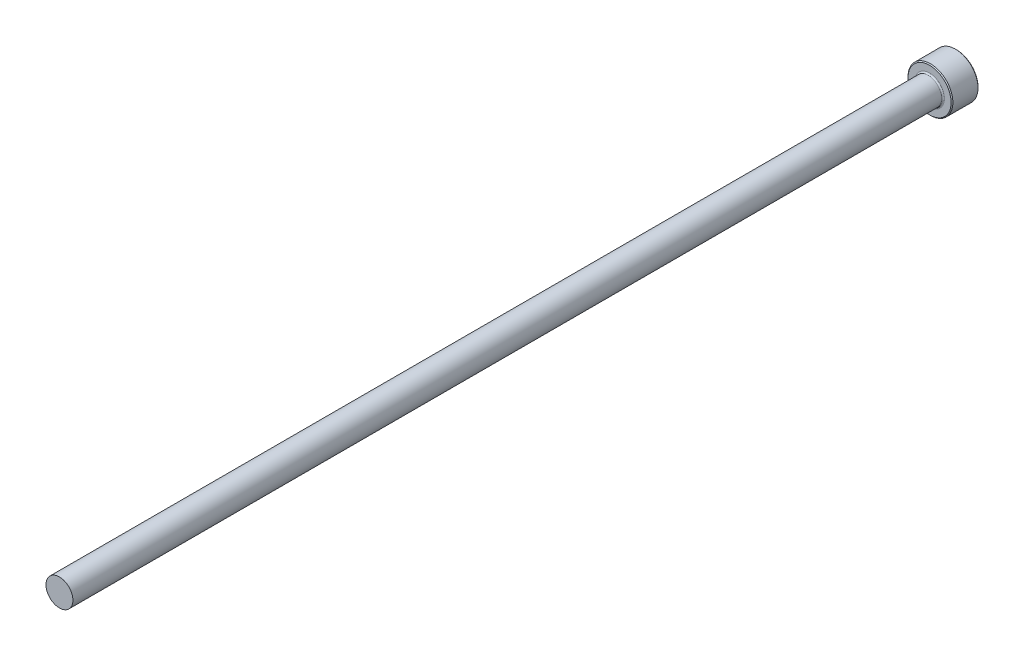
ISO-10303-21;
HEADER;
FILE_DESCRIPTION(('STEP AP214'),'2;1');
FILE_NAME('part.step','',(''),(''),'','','');
FILE_SCHEMA(('AUTOMOTIVE_DESIGN { 1 0 10303 214 1 1 1 1 }'));
ENDSEC;
DATA;
#1=APPLICATION_CONTEXT('core data for automotive mechanical design processes');
#2=APPLICATION_PROTOCOL_DEFINITION('international standard','automotive_design',2000,#1);
#3=PRODUCT_CONTEXT('',#1,'mechanical');
#4=PRODUCT('Part','Part','',(#3));
#5=PRODUCT_RELATED_PRODUCT_CATEGORY('part','',(#4));
#6=PRODUCT_DEFINITION_FORMATION('','',#4);
#7=PRODUCT_DEFINITION_CONTEXT('part definition',#1,'design');
#8=PRODUCT_DEFINITION('design','',#6,#7);
#9=PRODUCT_DEFINITION_SHAPE('','',#8);
#10=(LENGTH_UNIT() NAMED_UNIT(*) SI_UNIT(.MILLI.,.METRE.));
#11=(NAMED_UNIT(*) PLANE_ANGLE_UNIT() SI_UNIT($,.RADIAN.));
#12=(NAMED_UNIT(*) SI_UNIT($,.STERADIAN.) SOLID_ANGLE_UNIT());
#13=UNCERTAINTY_MEASURE_WITH_UNIT(LENGTH_MEASURE(1.E-05),#10,'distance_accuracy_value','');
#14=(GEOMETRIC_REPRESENTATION_CONTEXT(3) GLOBAL_UNCERTAINTY_ASSIGNED_CONTEXT((#13)) GLOBAL_UNIT_ASSIGNED_CONTEXT((#10,
#11,#12)) REPRESENTATION_CONTEXT('',''));
#15=CARTESIAN_POINT('',(0.,0.,0.));
#16=DIRECTION('',(0.,0.,1.));
#17=DIRECTION('',(1.,0.,0.));
#18=AXIS2_PLACEMENT_3D('',#15,#16,#17);
#19=CARTESIAN_POINT('',(0.,2.99999999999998,200.));
#20=DIRECTION('',(0.,0.,-1.));
#21=DIRECTION('',(-1.,0.,0.));
#22=AXIS2_PLACEMENT_3D('',#19,#20,#21);
#23=PLANE('',#22);
#24=CARTESIAN_POINT('',(0.,0.,200.));
#25=DIRECTION('',(0.,0.,1.));
#26=DIRECTION('',(1.,0.,0.));
#27=AXIS2_PLACEMENT_3D('',#24,#25,#26);
#28=CIRCLE('',#27,2.99999999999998);
#29=CARTESIAN_POINT('',(2.99999999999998,0.,200.));
#30=VERTEX_POINT('',#29);
#31=EDGE_CURVE('E50',#30,#30,#28,.T.);
#32=ORIENTED_EDGE('',*,*,#31,.T.);
#33=EDGE_LOOP('',(#32));
#34=FACE_BOUND('',#33,.T.);
#35=ADVANCED_FACE('F30',(#34),#23,.F.);
#36=CARTESIAN_POINT('',(0.,0.,109.050628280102));
#37=DIRECTION('',(0.,0.,1.));
#38=DIRECTION('',(1.,0.,0.));
#39=AXIS2_PLACEMENT_3D('',#36,#37,#38);
#40=CYLINDRICAL_SURFACE('',#39,2.99999999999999);
#41=ORIENTED_EDGE('',*,*,#31,.F.);
#42=EDGE_LOOP('',(#41));
#43=FACE_BOUND('',#42,.T.);
#44=CARTESIAN_POINT('',(0.,0.,6.3));
#45=DIRECTION('',(0.,0.,1.));
#46=DIRECTION('',(1.,0.,0.));
#47=AXIS2_PLACEMENT_3D('',#44,#45,#46);
#48=CIRCLE('',#47,3.);
#49=CARTESIAN_POINT('',(3.,0.,6.3));
#50=VERTEX_POINT('',#49);
#51=EDGE_CURVE('E53',#50,#50,#48,.T.);
#52=ORIENTED_EDGE('',*,*,#51,.T.);
#53=EDGE_LOOP('',(#52));
#54=FACE_BOUND('',#53,.T.);
#55=ADVANCED_FACE('F73',(#43,#54),#40,.T.);
#56=CARTESIAN_POINT('',(0.,0.,6.3));
#57=DIRECTION('',(0.,0.,1.));
#58=DIRECTION('',(1.,0.,0.));
#59=AXIS2_PLACEMENT_3D('',#56,#57,#58);
#60=TOROIDAL_SURFACE('',#59,3.3,0.3);
#61=ORIENTED_EDGE('',*,*,#51,.F.);
#62=EDGE_LOOP('',(#61));
#63=FACE_BOUND('',#62,.T.);
#64=CARTESIAN_POINT('',(0.,0.,6.00000000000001));
#65=DIRECTION('',(0.,0.,1.));
#66=DIRECTION('',(1.,0.,0.));
#67=AXIS2_PLACEMENT_3D('',#64,#65,#66);
#68=CIRCLE('',#67,3.3);
#69=CARTESIAN_POINT('',(3.3,0.,6.00000000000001));
#70=VERTEX_POINT('',#69);
#71=EDGE_CURVE('E56',#70,#70,#68,.T.);
#72=ORIENTED_EDGE('',*,*,#71,.T.);
#73=EDGE_LOOP('',(#72));
#74=FACE_BOUND('',#73,.T.);
#75=ADVANCED_FACE('F60',(#63,#74),#60,.F.);
#76=CARTESIAN_POINT('',(0.,5.,6.));
#77=DIRECTION('',(0.,0.,-1.));
#78=DIRECTION('',(-1.,0.,0.));
#79=AXIS2_PLACEMENT_3D('',#76,#77,#78);
#80=PLANE('',#79);
#81=CARTESIAN_POINT('',(0.,0.,6.));
#82=DIRECTION('',(0.,0.,-1.));
#83=DIRECTION('',(-1.,0.,0.));
#84=AXIS2_PLACEMENT_3D('',#81,#82,#83);
#85=CIRCLE('',#84,4.8);
#86=CARTESIAN_POINT('',(-4.8,0.,6.));
#87=VERTEX_POINT('',#86);
#88=EDGE_CURVE('E10',#87,#87,#85,.F.);
#89=ORIENTED_EDGE('',*,*,#88,.T.);
#90=EDGE_LOOP('',(#89));
#91=FACE_BOUND('',#90,.T.);
#92=ORIENTED_EDGE('',*,*,#71,.F.);
#93=EDGE_LOOP('',(#92));
#94=FACE_BOUND('',#93,.T.);
#95=ADVANCED_FACE('F62',(#91,#94),#80,.F.);
#96=CARTESIAN_POINT('',(0.,0.,109.050628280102));
#97=DIRECTION('',(0.,0.,1.));
#98=DIRECTION('',(1.,0.,0.));
#99=AXIS2_PLACEMENT_3D('',#96,#97,#98);
#100=CYLINDRICAL_SURFACE('',#99,5.);
#101=CARTESIAN_POINT('',(0.,0.,0.200000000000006));
#102=DIRECTION('',(0.,0.,1.));
#103=DIRECTION('',(1.,0.,0.));
#104=AXIS2_PLACEMENT_3D('',#101,#102,#103);
#105=CIRCLE('',#104,5.);
#106=CARTESIAN_POINT('',(5.,0.,0.200000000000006));
#107=VERTEX_POINT('',#106);
#108=EDGE_CURVE('E41',#107,#107,#105,.T.);
#109=ORIENTED_EDGE('',*,*,#108,.T.);
#110=EDGE_LOOP('',(#109));
#111=FACE_BOUND('',#110,.T.);
#112=CARTESIAN_POINT('',(0.,0.,5.80000000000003));
#113=DIRECTION('',(0.,0.,-1.));
#114=DIRECTION('',(-1.,0.,0.));
#115=AXIS2_PLACEMENT_3D('',#112,#113,#114);
#116=CIRCLE('',#115,5.);
#117=CARTESIAN_POINT('',(-5.,0.,5.80000000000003));
#118=VERTEX_POINT('',#117);
#119=EDGE_CURVE('E45',#118,#118,#116,.T.);
#120=ORIENTED_EDGE('',*,*,#119,.T.);
#121=EDGE_LOOP('',(#120));
#122=FACE_BOUND('',#121,.T.);
#123=ADVANCED_FACE('F64',(#111,#122),#100,.T.);
#124=CARTESIAN_POINT('',(0.,0.,0.));
#125=DIRECTION('',(0.,0.,1.));
#126=DIRECTION('',(1.,0.,0.));
#127=AXIS2_PLACEMENT_3D('',#124,#125,#126);
#128=PLANE('',#127);
#129=CARTESIAN_POINT('',(0.,0.,0.));
#130=DIRECTION('',(0.,0.,1.));
#131=DIRECTION('',(1.,0.,0.));
#132=AXIS2_PLACEMENT_3D('',#129,#130,#131);
#133=CIRCLE('',#132,4.8);
#134=CARTESIAN_POINT('',(4.8,0.,0.));
#135=VERTEX_POINT('',#134);
#136=EDGE_CURVE('E37',#135,#135,#133,.F.);
#137=ORIENTED_EDGE('',*,*,#136,.T.);
#138=EDGE_LOOP('',(#137));
#139=FACE_BOUND('',#138,.T.);
#140=ADVANCED_FACE('F70',(#139),#128,.F.);
#141=CARTESIAN_POINT('',(0.,0.,0.200000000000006));
#142=DIRECTION('',(0.,0.,1.));
#143=DIRECTION('',(1.,0.,0.));
#144=AXIS2_PLACEMENT_3D('',#141,#142,#143);
#145=CONICAL_SURFACE('',#144,5.,0.785398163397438);
#146=ORIENTED_EDGE('',*,*,#136,.F.);
#147=EDGE_LOOP('',(#146));
#148=FACE_BOUND('',#147,.T.);
#149=ORIENTED_EDGE('',*,*,#108,.F.);
#150=EDGE_LOOP('',(#149));
#151=FACE_BOUND('',#150,.T.);
#152=ADVANCED_FACE('F84',(#148,#151),#145,.T.);
#153=CARTESIAN_POINT('',(0.,0.,6.00000000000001));
#154=DIRECTION('',(0.,0.,-1.));
#155=DIRECTION('',(-1.,0.,0.));
#156=AXIS2_PLACEMENT_3D('',#153,#154,#155);
#157=CONICAL_SURFACE('',#156,4.8,0.785398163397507);
#158=CARTESIAN_POINT('',(-5.,0.,5.80000000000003));
#159=CARTESIAN_POINT('',(-4.99791666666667,0.,5.80208333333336));
#160=CARTESIAN_POINT('',(-4.99583333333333,0.,5.80416666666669));
#161=CARTESIAN_POINT('',(-4.99166666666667,0.,5.80833333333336));
#162=CARTESIAN_POINT('',(-4.98958333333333,0.,5.81041666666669));
#163=CARTESIAN_POINT('',(-4.98541666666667,0.,5.81458333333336));
#164=CARTESIAN_POINT('',(-4.98333333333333,0.,5.81666666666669));
#165=CARTESIAN_POINT('',(-4.97916666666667,0.,5.82083333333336));
#166=CARTESIAN_POINT('',(-4.97708333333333,0.,5.82291666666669));
#167=CARTESIAN_POINT('',(-4.97291666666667,0.,5.82708333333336));
#168=CARTESIAN_POINT('',(-4.97083333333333,0.,5.82916666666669));
#169=CARTESIAN_POINT('',(-4.96666666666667,0.,5.83333333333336));
#170=CARTESIAN_POINT('',(-4.96458333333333,0.,5.83541666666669));
#171=CARTESIAN_POINT('',(-4.96041666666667,0.,5.83958333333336));
#172=CARTESIAN_POINT('',(-4.95833333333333,0.,5.84166666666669));
#173=CARTESIAN_POINT('',(-4.95416666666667,0.,5.84583333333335));
#174=CARTESIAN_POINT('',(-4.95208333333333,0.,5.84791666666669));
#175=CARTESIAN_POINT('',(-4.94791666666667,0.,5.85208333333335));
#176=CARTESIAN_POINT('',(-4.94583333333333,0.,5.85416666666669));
#177=CARTESIAN_POINT('',(-4.94166666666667,0.,5.85833333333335));
#178=CARTESIAN_POINT('',(-4.93958333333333,0.,5.86041666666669));
#179=CARTESIAN_POINT('',(-4.93541666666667,0.,5.86458333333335));
#180=CARTESIAN_POINT('',(-4.93333333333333,0.,5.86666666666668));
#181=CARTESIAN_POINT('',(-4.92916666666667,0.,5.87083333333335));
#182=CARTESIAN_POINT('',(-4.92708333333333,0.,5.87291666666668));
#183=CARTESIAN_POINT('',(-4.92291666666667,0.,5.87708333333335));
#184=CARTESIAN_POINT('',(-4.92083333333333,0.,5.87916666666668));
#185=CARTESIAN_POINT('',(-4.91666666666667,0.,5.88333333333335));
#186=CARTESIAN_POINT('',(-4.91458333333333,0.,5.88541666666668));
#187=CARTESIAN_POINT('',(-4.91041666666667,0.,5.88958333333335));
#188=CARTESIAN_POINT('',(-4.90833333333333,0.,5.89166666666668));
#189=CARTESIAN_POINT('',(-4.90416666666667,0.,5.89583333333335));
#190=CARTESIAN_POINT('',(-4.90208333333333,0.,5.89791666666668));
#191=CARTESIAN_POINT('',(-4.89791666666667,0.,5.90208333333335));
#192=CARTESIAN_POINT('',(-4.89583333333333,0.,5.90416666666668));
#193=CARTESIAN_POINT('',(-4.89166666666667,0.,5.90833333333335));
#194=CARTESIAN_POINT('',(-4.88958333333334,0.,5.91041666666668));
#195=CARTESIAN_POINT('',(-4.88541666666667,0.,5.91458333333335));
#196=CARTESIAN_POINT('',(-4.88333333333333,0.,5.91666666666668));
#197=CARTESIAN_POINT('',(-4.87916666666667,0.,5.92083333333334));
#198=CARTESIAN_POINT('',(-4.87708333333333,0.,5.92291666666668));
#199=CARTESIAN_POINT('',(-4.87291666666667,0.,5.92708333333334));
#200=CARTESIAN_POINT('',(-4.87083333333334,0.,5.92916666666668));
#201=CARTESIAN_POINT('',(-4.86666666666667,0.,5.93333333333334));
#202=CARTESIAN_POINT('',(-4.86458333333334,0.,5.93541666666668));
#203=CARTESIAN_POINT('',(-4.86041666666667,0.,5.93958333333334));
#204=CARTESIAN_POINT('',(-4.85833333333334,0.,5.94166666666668));
#205=CARTESIAN_POINT('',(-4.85416666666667,0.,5.94583333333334));
#206=CARTESIAN_POINT('',(-4.85208333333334,0.,5.94791666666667));
#207=CARTESIAN_POINT('',(-4.84791666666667,0.,5.95208333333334));
#208=CARTESIAN_POINT('',(-4.84583333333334,0.,5.95416666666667));
#209=CARTESIAN_POINT('',(-4.84166666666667,0.,5.95833333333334));
#210=CARTESIAN_POINT('',(-4.83958333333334,0.,5.96041666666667));
#211=CARTESIAN_POINT('',(-4.83541666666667,0.,5.96458333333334));
#212=CARTESIAN_POINT('',(-4.83333333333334,0.,5.96666666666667));
#213=CARTESIAN_POINT('',(-4.82916666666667,0.,5.97083333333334));
#214=CARTESIAN_POINT('',(-4.82708333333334,0.,5.97291666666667));
#215=CARTESIAN_POINT('',(-4.82291666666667,0.,5.97708333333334));
#216=CARTESIAN_POINT('',(-4.82083333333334,0.,5.97916666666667));
#217=CARTESIAN_POINT('',(-4.81666666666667,0.,5.98333333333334));
#218=CARTESIAN_POINT('',(-4.81458333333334,0.,5.98541666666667));
#219=CARTESIAN_POINT('',(-4.81041666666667,0.,5.98958333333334));
#220=CARTESIAN_POINT('',(-4.80833333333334,0.,5.99166666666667));
#221=CARTESIAN_POINT('',(-4.80416666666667,0.,5.99583333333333));
#222=CARTESIAN_POINT('',(-4.80208333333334,0.,5.99791666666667));
#223=CARTESIAN_POINT('',(-4.8,0.,6.));
#224=B_SPLINE_CURVE_WITH_KNOTS('',3,(#158,#159,#160,#161,#162,#163,#164,#165,#166,#167,#168,
#169,#170,#171,#172,#173,#174,#175,#176,#177,#178,#179,#180,#181,#182,#183,#184,#185,#186,#187,
#188,#189,#190,#191,#192,#193,#194,#195,#196,#197,#198,#199,#200,#201,#202,#203,#204,#205,#206,
#207,#208,#209,#210,#211,#212,#213,#214,#215,#216,#217,#218,#219,#220,#221,#222,#223),
.UNSPECIFIED.,.F.,.F.,(4,2,2,2,2,2,2,2,2,2,2,2,2,2,2,2,2,2,2,2,2,2,2,2,2,2,2,2,2,2,2,2,4),(0.,
0.00883883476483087,0.0176776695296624,0.0265165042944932,0.0353553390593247,0.0441941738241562,
0.0530330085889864,0.0618718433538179,0.0707106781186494,0.0795495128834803,0.0883883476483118,
0.0972271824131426,0.106066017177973,0.114904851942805,0.123743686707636,0.132582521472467,
0.141421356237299,0.15026019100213,0.159099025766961,0.167937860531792,0.176776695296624,
0.185615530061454,0.194454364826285,0.203293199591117,0.212132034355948,0.220970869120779,
0.229809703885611,0.238648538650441,0.247487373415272,0.256326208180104,0.265165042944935,
0.274003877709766,0.282842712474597),.UNSPECIFIED.);
#225=EDGE_CURVE('BSEAM32',#118,#87,#224,.T.);
#226=ORIENTED_EDGE('',*,*,#119,.F.);
#227=ORIENTED_EDGE('',*,*,#88,.F.);
#228=ORIENTED_EDGE('',*,*,#225,.T.);
#229=ORIENTED_EDGE('',*,*,#225,.F.);
#230=EDGE_LOOP('',(#226,#228,#227,#229));
#231=FACE_BOUND('',#230,.T.);
#232=ADVANCED_FACE('F32',(#231),#157,.T.);
#233=CLOSED_SHELL('',(#35,#55,#75,#95,#123,#140,#152,#232));
#234=MANIFOLD_SOLID_BREP('B2',#233);
#235=ADVANCED_BREP_SHAPE_REPRESENTATION('',(#18,#234),#14);
#236=SHAPE_DEFINITION_REPRESENTATION(#9,#235);
ENDSEC;
END-ISO-10303-21;
